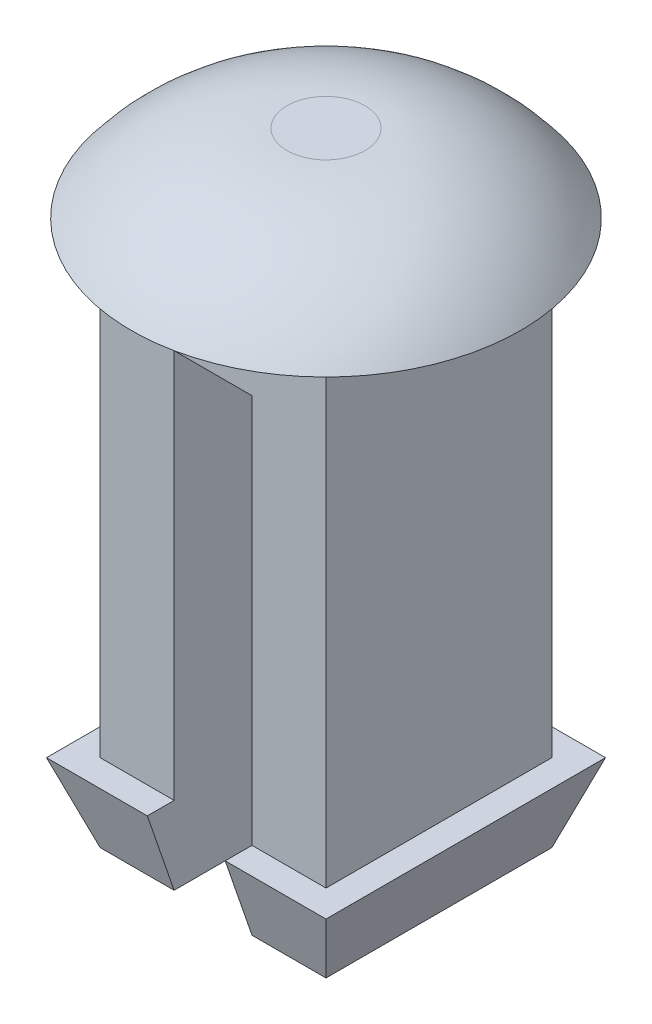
from build123d import *

# Parameters (mm, degrees)
SKETCH1_W                     = 7.366
SKETCH1_H                     = 7.366
BOSS_EXTRUDE1_DEPTH           = 17.78
SKETCH2_W                     = 2.54
SKETCH2_H                     = 7.366
BOSS_EXTRUDE2_DEPTH           = 2.54
BOSS_EXTRUDE2_DRAFT           = 19
BOSS_EXTRUDE2_PROFILE_2_DEPTH = 2.54
BOSS_EXTRUDE2_PROFILE_2_DRAFT = 19
SKETCH3_W                     = 2.54
SKETCH3_H                     = 16.365642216
CUT_EXTRUDE1_DEPTH            = 15.24


with BuildPart() as part:
    # Sketch1 → Boss-Extrude1 (new body)
    with BuildSketch(Plane(origin=(0, 0, 0), x_dir=(1, 0, 0), z_dir=(0, 1, 0))):
        Rectangle(SKETCH1_W, SKETCH1_H)
    extrude(amount=BOSS_EXTRUDE1_DEPTH)


with BuildPart() as boss_extrude2_tool:
    # Sketch2 → Boss-Extrude2 (with draft: the straight prism first)
    with BuildSketch(Plane.XZ):
        with Locations((2.413, 0)):
            Rectangle(SKETCH2_W, SKETCH2_H)
    extrude(amount=-BOSS_EXTRUDE2_DEPTH)
    # Boss-Extrude2: the draft: its side faces are tilted about the plane it starts from
    boss_extrude2_sides = [boss_extrude2_tool.faces().sort_by_distance(p)[0] for p in [
        (2.413, 1.27, 3.683),
        (1.143, 1.27, 0),
        (2.413, 1.27, -3.683),
        (3.683, 1.27, 0),
    ]]
    draft(boss_extrude2_sides, Plane.XZ, BOSS_EXTRUDE2_DRAFT)


with BuildPart() as part_1:
    add(part.part)

    # Boss-Extrude2: add boss_extrude2_tool
    add(boss_extrude2_tool.part)


with BuildPart() as boss_extrude2_profile_2_tool:
    # Sketch2 → Boss-Extrude2 profile 2 (with draft: the straight prism first)
    with BuildSketch(Plane.XZ):
        with Locations((-2.413, 0)):
            Rectangle(SKETCH2_W, SKETCH2_H)
    extrude(amount=-BOSS_EXTRUDE2_PROFILE_2_DEPTH)
    # Boss-Extrude2 profile 2: the draft: its side faces are tilted about the plane it starts from
    boss_extrude2_profile_2_sides = [boss_extrude2_profile_2_tool.faces().sort_by_distance(p)[0] for p in [
        (-2.413, 1.27, 3.683),
        (-3.683, 1.27, 0),
        (-2.413, 1.27, -3.683),
        (-1.143, 1.27, 0),
    ]]
    draft(boss_extrude2_profile_2_sides, Plane.XZ, BOSS_EXTRUDE2_PROFILE_2_DRAFT)


with BuildPart() as part_2:
    add(part_1.part)

    # Boss-Extrude2 profile 2: add boss_extrude2_profile_2_tool
    add(boss_extrude2_profile_2_tool.part)

    # Sketch3 → Cut-Extrude1 (cut)
    with BuildSketch(Plane.XZ):
        Rectangle(SKETCH3_W, SKETCH3_H)
    extrude(amount=-CUT_EXTRUDE1_DEPTH, mode=Mode.SUBTRACT)

    # Sketch4 → Revolve1 (revolve)
    with BuildSketch(Plane.XY, mode=Mode.PRIVATE) as revolve1_sk:
        with BuildLine():
            Line((0, 17.78), (0, 20.32))
            Line((0, 20.32), (1.27, 20.32))
            ThreePointArc((1.27, 20.32), (4.109806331, 19.649612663), (6.35, 17.78))
            Line((6.35, 17.78), (0, 17.78))
        make_face()
    revolve(revolve1_sk.sketch.rotate(Axis((0, 0, 0), (0, 1, 0)), 90), axis=Axis((0, 0, 0), (0, 1, 0)))


solid = part_2.part
